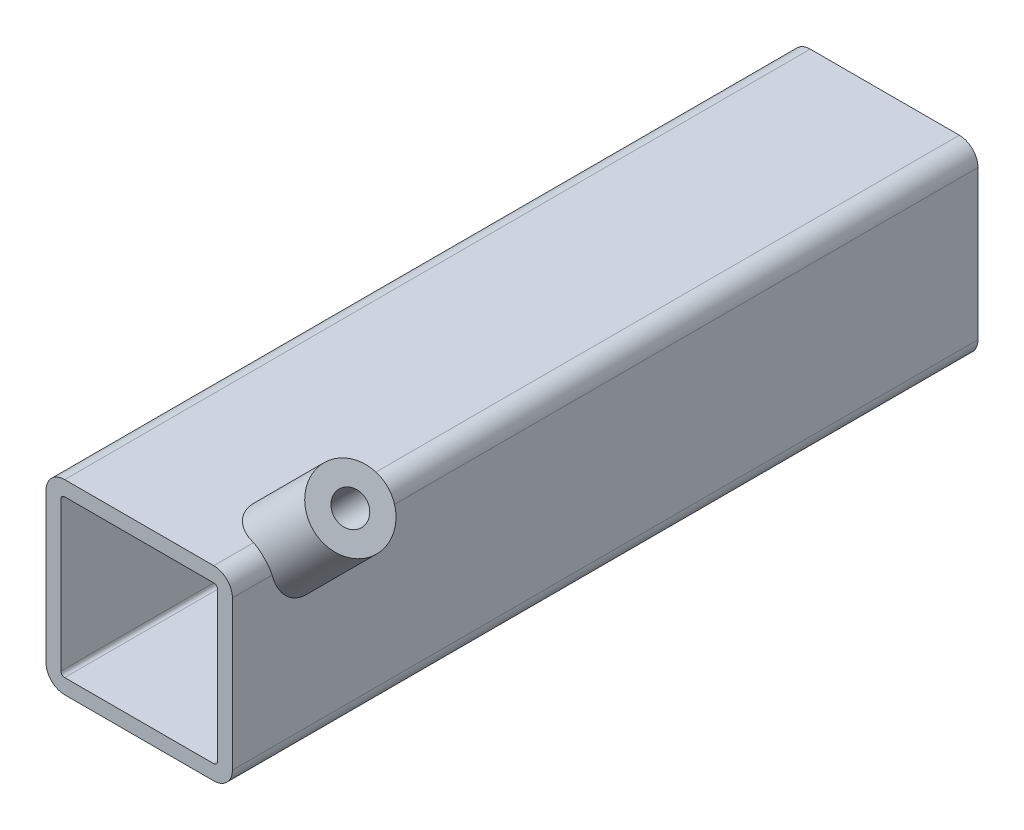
ISO-10303-21;
HEADER;
FILE_DESCRIPTION(('STEP AP214'),'2;1');
FILE_NAME('part.step','',(''),(''),'','','');
FILE_SCHEMA(('AUTOMOTIVE_DESIGN { 1 0 10303 214 1 1 1 1 }'));
ENDSEC;
DATA;
#1=APPLICATION_CONTEXT('core data for automotive mechanical design processes');
#2=APPLICATION_PROTOCOL_DEFINITION('international standard','automotive_design',2000,#1);
#3=PRODUCT_CONTEXT('',#1,'mechanical');
#4=PRODUCT('Part','Part','',(#3));
#5=PRODUCT_RELATED_PRODUCT_CATEGORY('part','',(#4));
#6=PRODUCT_DEFINITION_FORMATION('','',#4);
#7=PRODUCT_DEFINITION_CONTEXT('part definition',#1,'design');
#8=PRODUCT_DEFINITION('design','',#6,#7);
#9=PRODUCT_DEFINITION_SHAPE('','',#8);
#10=(LENGTH_UNIT() NAMED_UNIT(*) SI_UNIT(.MILLI.,.METRE.));
#11=(NAMED_UNIT(*) PLANE_ANGLE_UNIT() SI_UNIT($,.RADIAN.));
#12=(NAMED_UNIT(*) SI_UNIT($,.STERADIAN.) SOLID_ANGLE_UNIT());
#13=UNCERTAINTY_MEASURE_WITH_UNIT(LENGTH_MEASURE(1.E-05),#10,'distance_accuracy_value','');
#14=(GEOMETRIC_REPRESENTATION_CONTEXT(3) GLOBAL_UNCERTAINTY_ASSIGNED_CONTEXT((#13)) GLOBAL_UNIT_ASSIGNED_CONTEXT((#10,
#11,#12)) REPRESENTATION_CONTEXT('',''));
#15=CARTESIAN_POINT('',(0.,0.,0.));
#16=DIRECTION('',(0.,0.,1.));
#17=DIRECTION('',(1.,0.,0.));
#18=AXIS2_PLACEMENT_3D('',#15,#16,#17);
#19=CARTESIAN_POINT('',(45.,-5.,0.));
#20=DIRECTION('',(0.,0.,1.));
#21=DIRECTION('',(1.,0.,0.));
#22=AXIS2_PLACEMENT_3D('',#19,#20,#21);
#23=CYLINDRICAL_SURFACE('',#22,1.);
#24=DIRECTION('',(0.,0.,1.));
#25=VECTOR('',#24,1.);
#26=CARTESIAN_POINT('',(45.,-4.,0.));
#27=LINE('',#26,#25);
#28=CARTESIAN_POINT('',(45.,-4.,184.19076365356));
#29=VERTEX_POINT('',#28);
#30=CARTESIAN_POINT('',(45.,-4.,200.));
#31=VERTEX_POINT('',#30);
#32=EDGE_CURVE('E50',#29,#31,#27,.T.);
#33=ORIENTED_EDGE('',*,*,#32,.F.);
#34=CARTESIAN_POINT('',(45.,-4.,184.19076365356));
#35=CARTESIAN_POINT('',(45.0559582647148,-3.99995951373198,184.197454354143));
#36=CARTESIAN_POINT('',(45.1119232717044,-4.0046950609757,184.204103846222));
#37=CARTESIAN_POINT('',(45.2223794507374,-4.02344244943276,184.216656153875));
#38=CARTESIAN_POINT('',(45.2768702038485,-4.03745689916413,184.222558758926));
#39=CARTESIAN_POINT('',(45.3829114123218,-4.07450490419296,184.232953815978));
#40=CARTESIAN_POINT('',(45.4344588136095,-4.09754763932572,184.237444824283));
#41=CARTESIAN_POINT('',(45.5330191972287,-4.15202775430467,184.244506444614));
#42=CARTESIAN_POINT('',(45.5800349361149,-4.18345998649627,184.247078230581));
#43=CARTESIAN_POINT('',(45.6673764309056,-4.25322116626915,184.24998609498));
#44=CARTESIAN_POINT('',(45.7078042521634,-4.29142076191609,184.250360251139));
#45=CARTESIAN_POINT('',(45.7817667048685,-4.37397129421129,184.248933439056));
#46=CARTESIAN_POINT('',(45.8153002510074,-4.41832319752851,184.247132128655));
#47=CARTESIAN_POINT('',(45.8741924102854,-4.51134279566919,184.24158518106));
#48=CARTESIAN_POINT('',(45.8996376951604,-4.55995707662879,184.237861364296));
#49=CARTESIAN_POINT('',(45.9422124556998,-4.66056359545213,184.228878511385));
#50=CARTESIAN_POINT('',(45.9593437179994,-4.71255510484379,184.223619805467));
#51=CARTESIAN_POINT('',(45.9813894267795,-4.80394024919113,184.213702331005));
#52=CARTESIAN_POINT('',(45.988366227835,-4.84287622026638,184.209274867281));
#53=CARTESIAN_POINT('',(45.9976705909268,-4.92120482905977,184.200156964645));
#54=CARTESIAN_POINT('',(46.0000056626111,-4.96059662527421,184.195466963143));
#55=CARTESIAN_POINT('',(46.,-5.00000000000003,184.19076365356));
#56=B_SPLINE_CURVE_WITH_KNOTS('',3,(#34,#35,#36,#37,#38,#39,#40,#41,#42,#43,#44,#45,#46,#47,#48,
#49,#50,#51,#52,#53,#54,#55),.UNSPECIFIED.,.F.,.F.,(4,2,2,2,2,2,2,2,2,2,4),(0.,
0.168877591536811,0.337802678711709,0.506899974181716,0.675893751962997,0.841950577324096,
1.00803352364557,1.17227157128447,1.33647430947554,1.45562186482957,1.5745764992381),.UNSPECIFIED.);
#57=CARTESIAN_POINT('',(46.,-5.00000000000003,184.19076365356));
#58=VERTEX_POINT('',#57);
#59=EDGE_CURVE('E44',#29,#58,#56,.T.);
#60=ORIENTED_EDGE('',*,*,#59,.T.);
#61=DIRECTION('',(0.,0.,1.));
#62=VECTOR('',#61,1.);
#63=CARTESIAN_POINT('',(46.,-5.00000000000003,0.));
#64=LINE('',#63,#62);
#65=CARTESIAN_POINT('',(46.,-5.00000000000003,200.));
#66=VERTEX_POINT('',#65);
#67=EDGE_CURVE('E577',#58,#66,#64,.T.);
#68=ORIENTED_EDGE('',*,*,#67,.T.);
#69=CARTESIAN_POINT('',(45.,-5.,200.));
#70=DIRECTION('',(0.,0.,1.));
#71=DIRECTION('',(1.,0.,0.));
#72=AXIS2_PLACEMENT_3D('',#69,#70,#71);
#73=CIRCLE('',#72,1.);
#74=EDGE_CURVE('E534',#66,#31,#73,.T.);
#75=ORIENTED_EDGE('',*,*,#74,.T.);
#76=EDGE_LOOP('',(#33,#60,#68,#75));
#77=FACE_BOUND('',#76,.T.);
#78=ADVANCED_FACE('F29',(#77),#23,.F.);
#79=CARTESIAN_POINT('',(50.,-5.00000000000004,200.));
#80=DIRECTION('',(-1.,0.,0.));
#81=DIRECTION('',(0.,-1.,0.));
#82=AXIS2_PLACEMENT_3D('',#79,#80,#81);
#83=PLANE('',#82);
#84=CARTESIAN_POINT('',(50.,0.,180.));
#85=DIRECTION('',(-1.,0.,0.));
#86=DIRECTION('',(0.,-1.,0.));
#87=AXIS2_PLACEMENT_3D('',#84,#85,#86);
#88=ELLIPSE('',#87,14.1421356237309,10.);
#89=CARTESIAN_POINT('',(50.,-5.00000000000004,189.354143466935));
#90=VERTEX_POINT('',#89);
#91=CARTESIAN_POINT('',(50.,-5.00000000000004,170.645856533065));
#92=VERTEX_POINT('',#91);
#93=EDGE_CURVE('E278',#90,#92,#88,.F.);
#94=ORIENTED_EDGE('',*,*,#93,.F.);
#95=DIRECTION('',(0.,0.,-1.));
#96=VECTOR('',#95,1.);
#97=CARTESIAN_POINT('',(50.,-5.00000000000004,200.));
#98=LINE('',#97,#96);
#99=CARTESIAN_POINT('',(50.,-5.00000000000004,200.));
#100=VERTEX_POINT('',#99);
#101=EDGE_CURVE('E338',#100,#90,#98,.T.);
#102=ORIENTED_EDGE('',*,*,#101,.F.);
#103=DIRECTION('',(0.,1.,0.));
#104=VECTOR('',#103,1.);
#105=CARTESIAN_POINT('',(50.,-5.00000000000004,200.));
#106=LINE('',#105,#104);
#107=CARTESIAN_POINT('',(50.,-45.,200.));
#108=VERTEX_POINT('',#107);
#109=EDGE_CURVE('E305',#108,#100,#106,.T.);
#110=ORIENTED_EDGE('',*,*,#109,.F.);
#111=DIRECTION('',(0.,0.,-1.));
#112=VECTOR('',#111,1.);
#113=CARTESIAN_POINT('',(50.,-45.,200.));
#114=LINE('',#113,#112);
#115=CARTESIAN_POINT('',(50.,-45.,0.));
#116=VERTEX_POINT('',#115);
#117=EDGE_CURVE('E340',#108,#116,#114,.T.);
#118=ORIENTED_EDGE('',*,*,#117,.T.);
#119=DIRECTION('',(0.,1.,0.));
#120=VECTOR('',#119,1.);
#121=CARTESIAN_POINT('',(50.,-5.00000000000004,0.));
#122=LINE('',#121,#120);
#123=CARTESIAN_POINT('',(50.,-5.00000000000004,0.));
#124=VERTEX_POINT('',#123);
#125=EDGE_CURVE('E284',#116,#124,#122,.T.);
#126=ORIENTED_EDGE('',*,*,#125,.T.);
#127=EDGE_CURVE('E337',#92,#124,#98,.T.);
#128=ORIENTED_EDGE('',*,*,#127,.F.);
#129=EDGE_LOOP('',(#94,#102,#110,#118,#126,#128));
#130=FACE_BOUND('',#129,.T.);
#131=ADVANCED_FACE('F249',(#130),#83,.F.);
#132=CARTESIAN_POINT('',(45.,-5.,200.));
#133=DIRECTION('',(0.,0.,-1.));
#134=DIRECTION('',(-1.,0.,0.));
#135=AXIS2_PLACEMENT_3D('',#132,#133,#134);
#136=CYLINDRICAL_SURFACE('',#135,5.);
#137=CARTESIAN_POINT('',(40.,-5.,189.354143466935));
#138=CARTESIAN_POINT('',(40.0000008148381,-4.72265838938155,189.280016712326));
#139=CARTESIAN_POINT('',(40.0230750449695,-4.44531545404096,189.204985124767));
#140=CARTESIAN_POINT('',(40.1154234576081,-3.89613450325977,189.060945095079));
#141=CARTESIAN_POINT('',(40.184782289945,-3.62430751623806,188.991947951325));
#142=CARTESIAN_POINT('',(40.3233319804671,-3.225525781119,188.899220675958));
#143=CARTESIAN_POINT('',(40.3754602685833,-3.09373839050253,188.870040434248));
#144=CARTESIAN_POINT('',(40.4911309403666,-2.83430337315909,188.816370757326));
#145=CARTESIAN_POINT('',(40.5546680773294,-2.70665387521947,188.791879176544));
#146=CARTESIAN_POINT('',(40.6928077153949,-2.45668198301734,188.748559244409));
#147=CARTESIAN_POINT('',(40.7673968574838,-2.33435338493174,188.729724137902));
#148=CARTESIAN_POINT('',(40.9272389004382,-2.09600346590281,188.698473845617));
#149=CARTESIAN_POINT('',(41.0124904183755,-1.97998132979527,188.686057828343));
#150=CARTESIAN_POINT('',(41.1848327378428,-1.76554810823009,188.669007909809));
#151=CARTESIAN_POINT('',(41.2710636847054,-1.66649253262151,188.663772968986));
#152=CARTESIAN_POINT('',(41.4511287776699,-1.4754087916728,188.659277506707));
#153=CARTESIAN_POINT('',(41.5449624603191,-1.38338019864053,188.660016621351));
#154=CARTESIAN_POINT('',(41.7394532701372,-1.20710376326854,188.66744051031));
#155=CARTESIAN_POINT('',(41.8401105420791,-1.12285608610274,188.67412541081));
#156=CARTESIAN_POINT('',(42.0473877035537,-0.962769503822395,188.693182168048));
#157=CARTESIAN_POINT('',(42.1540075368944,-0.886930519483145,188.705553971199));
#158=CARTESIAN_POINT('',(42.3651026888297,-0.748864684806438,188.734534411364));
#159=CARTESIAN_POINT('',(42.4692529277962,-0.686069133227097,188.750808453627));
#160=CARTESIAN_POINT('',(42.681305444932,-0.568479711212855,188.787419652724));
#161=CARTESIAN_POINT('',(42.7892089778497,-0.513688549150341,188.807758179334));
#162=CARTESIAN_POINT('',(43.1175156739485,-0.361643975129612,188.874019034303));
#163=CARTESIAN_POINT('',(43.3426487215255,-0.276632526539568,188.925206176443));
#164=CARTESIAN_POINT('',(43.8219139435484,-0.133747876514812,189.041682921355));
#165=CARTESIAN_POINT('',(44.0767943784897,-0.0791387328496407,189.107841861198));
#166=CARTESIAN_POINT('',(44.5909471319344,-0.0100042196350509,189.244165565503));
#167=CARTESIAN_POINT('',(44.8502221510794,0.00449553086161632,189.314332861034));
#168=CARTESIAN_POINT('',(45.3970861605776,-0.0075156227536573,189.459915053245));
#169=CARTESIAN_POINT('',(45.6846773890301,-0.0386744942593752,189.535067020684));
#170=CARTESIAN_POINT('',(46.1104389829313,-0.122712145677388,189.639564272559));
#171=CARTESIAN_POINT('',(46.2514992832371,-0.156970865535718,189.673041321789));
#172=CARTESIAN_POINT('',(46.5308289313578,-0.237892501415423,189.736354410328));
#173=CARTESIAN_POINT('',(46.6690996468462,-0.2845491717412,189.766192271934));
#174=CARTESIAN_POINT('',(46.9387964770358,-0.388977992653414,189.820766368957));
#175=CARTESIAN_POINT('',(47.0703062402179,-0.44648318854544,189.845600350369));
#176=CARTESIAN_POINT('',(47.3285138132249,-0.572961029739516,189.890251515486));
#177=CARTESIAN_POINT('',(47.4552139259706,-0.641928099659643,189.910071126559));
#178=CARTESIAN_POINT('',(47.7026611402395,-0.79090639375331,189.944106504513));
#179=CARTESIAN_POINT('',(47.8234111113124,-0.870912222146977,189.958324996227));
#180=CARTESIAN_POINT('',(48.0578626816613,-1.0414046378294,189.980729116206));
#181=CARTESIAN_POINT('',(48.1715650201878,-1.13189012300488,189.988915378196));
#182=CARTESIAN_POINT('',(48.3797733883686,-1.31296742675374,189.998490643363));
#183=CARTESIAN_POINT('',(48.4750598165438,-1.40263259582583,190.00048066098));
#184=CARTESIAN_POINT('',(48.6583273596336,-1.58917310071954,189.999323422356));
#185=CARTESIAN_POINT('',(48.7463060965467,-1.68605076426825,189.996174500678));
#186=CARTESIAN_POINT('',(48.914224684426,-1.88617604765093,189.984820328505));
#187=CARTESIAN_POINT('',(48.9941684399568,-1.98942053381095,189.976617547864));
#188=CARTESIAN_POINT('',(49.1455561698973,-2.20154484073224,189.955365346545));
#189=CARTESIAN_POINT('',(49.2169969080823,-2.3104267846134,189.942314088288));
#190=CARTESIAN_POINT('',(49.3487716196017,-2.52937678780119,189.912183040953));
#191=CARTESIAN_POINT('',(49.4093887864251,-2.6392942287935,189.895246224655));
#192=CARTESIAN_POINT('',(49.5219771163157,-2.86285037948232,189.857525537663));
#193=CARTESIAN_POINT('',(49.57394527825,-2.97649036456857,189.836740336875));
#194=CARTESIAN_POINT('',(49.7165361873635,-3.32184055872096,189.769282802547));
#195=CARTESIAN_POINT('',(49.7939446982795,-3.55814713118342,189.717484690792));
#196=CARTESIAN_POINT('',(49.9169476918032,-4.05461639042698,189.600442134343));
#197=CARTESIAN_POINT('',(49.959846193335,-4.31527073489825,189.534497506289));
#198=CARTESIAN_POINT('',(50.0043173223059,-4.83888911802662,189.397699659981));
#199=CARTESIAN_POINT('',(50.005860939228,-5.10185464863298,189.326843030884));
#200=CARTESIAN_POINT('',(49.9658816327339,-5.64975877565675,189.180050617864));
#201=CARTESIAN_POINT('',(49.920344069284,-5.93446889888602,189.104254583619));
#202=CARTESIAN_POINT('',(49.8153130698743,-6.35411576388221,188.998658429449));
#203=CARTESIAN_POINT('',(49.774147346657,-6.4928401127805,188.96479204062));
#204=CARTESIAN_POINT('',(49.6796217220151,-6.76695289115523,188.900892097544));
#205=CARTESIAN_POINT('',(49.6262682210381,-6.90234303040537,188.870856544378));
#206=CARTESIAN_POINT('',(49.508600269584,-7.16634036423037,188.816232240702));
#207=CARTESIAN_POINT('',(49.44450432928,-7.29502635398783,188.79155385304));
#208=CARTESIAN_POINT('',(49.3050140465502,-7.54707321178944,188.747943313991));
#209=CARTESIAN_POINT('',(49.2296257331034,-7.67043687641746,188.729008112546));
#210=CARTESIAN_POINT('',(49.0680728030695,-7.91062028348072,188.697697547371));
#211=CARTESIAN_POINT('',(48.9819182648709,-8.02744599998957,188.685316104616));
#212=CARTESIAN_POINT('',(48.7994774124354,-8.25346805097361,188.667658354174));
#213=CARTESIAN_POINT('',(48.7031925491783,-8.36266547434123,188.662381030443));
#214=CARTESIAN_POINT('',(48.5141854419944,-8.55902445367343,188.659379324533));
#215=CARTESIAN_POINT('',(48.4225533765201,-8.64722612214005,188.660783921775));
#216=CARTESIAN_POINT('',(48.2329479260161,-8.81630537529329,188.669145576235));
#217=CARTESIAN_POINT('',(48.1349725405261,-8.89718063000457,188.676104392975));
#218=CARTESIAN_POINT('',(47.9335068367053,-9.05099891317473,188.695327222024));
#219=CARTESIAN_POINT('',(47.8300176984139,-9.12394362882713,188.707590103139));
#220=CARTESIAN_POINT('',(47.618292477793,-9.26151498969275,188.736991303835));
#221=CARTESIAN_POINT('',(47.5100545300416,-9.32613832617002,188.754131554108));
#222=CARTESIAN_POINT('',(47.184634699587,-9.50415569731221,188.811145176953));
#223=CARTESIAN_POINT('',(46.961765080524,-9.60546426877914,188.857133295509));
#224=CARTESIAN_POINT('',(46.5062037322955,-9.77393829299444,188.960625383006));
#225=CARTESIAN_POINT('',(46.2735085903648,-9.84109177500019,189.018133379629));
#226=CARTESIAN_POINT('',(45.7747538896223,-9.94693240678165,189.14643225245));
#227=CARTESIAN_POINT('',(45.5079842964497,-9.98135253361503,189.2179899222));
#228=CARTESIAN_POINT('',(44.9722544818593,-10.0071093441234,189.361653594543));
#229=CARTESIAN_POINT('',(44.7032929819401,-9.99841877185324,189.433759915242));
#230=CARTESIAN_POINT('',(44.2915496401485,-9.95169753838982,189.540012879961));
#231=CARTESIAN_POINT('',(44.1474678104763,-9.92894988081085,189.576402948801));
#232=CARTESIAN_POINT('',(43.8612083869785,-9.87077611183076,189.646355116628));
#233=CARTESIAN_POINT('',(43.7190300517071,-9.83535509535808,189.679918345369));
#234=CARTESIAN_POINT('',(43.4375561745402,-9.75187589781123,189.743275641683));
#235=CARTESIAN_POINT('',(43.2982608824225,-9.70381662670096,189.773069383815));
#236=CARTESIAN_POINT('',(43.023739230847,-9.59523261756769,189.827999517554));
#237=CARTESIAN_POINT('',(42.8885106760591,-9.53471474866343,189.853138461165));
#238=CARTESIAN_POINT('',(42.630818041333,-9.40528839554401,189.896728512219));
#239=CARTESIAN_POINT('',(42.5080657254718,-9.33705469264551,189.915479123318));
#240=CARTESIAN_POINT('',(42.2682936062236,-9.19017100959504,189.947631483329));
#241=CARTESIAN_POINT('',(42.1512710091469,-9.1115261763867,189.961035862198));
#242=CARTESIAN_POINT('',(41.9240087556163,-8.944384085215,189.982108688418));
#243=CARTESIAN_POINT('',(41.8137662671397,-8.85589098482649,189.989779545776));
#244=CARTESIAN_POINT('',(41.601038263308,-8.66974524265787,189.999162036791));
#245=CARTESIAN_POINT('',(41.498552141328,-8.57209331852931,190.000874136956));
#246=CARTESIAN_POINT('',(41.3115267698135,-8.37810174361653,189.998411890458));
#247=CARTESIAN_POINT('',(41.2262064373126,-8.28250609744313,189.994777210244));
#248=CARTESIAN_POINT('',(41.0632623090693,-8.08520210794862,189.982670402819));
#249=CARTESIAN_POINT('',(40.9856410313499,-7.98349178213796,189.974196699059));
#250=CARTESIAN_POINT('',(40.8386310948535,-7.7747608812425,189.952617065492));
#251=CARTESIAN_POINT('',(40.7692418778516,-7.66774066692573,189.939511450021));
#252=CARTESIAN_POINT('',(40.6390599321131,-7.44916486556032,189.908987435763));
#253=CARTESIAN_POINT('',(40.5782703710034,-7.33760762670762,189.891567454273));
#254=CARTESIAN_POINT('',(40.4093571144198,-6.99748285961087,189.833443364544));
#255=CARTESIAN_POINT('',(40.3144915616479,-6.76318051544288,189.786844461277));
#256=CARTESIAN_POINT('',(40.1616411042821,-6.28574567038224,189.682042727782));
#257=CARTESIAN_POINT('',(40.1036206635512,-6.04262191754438,189.62385114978));
#258=CARTESIAN_POINT('',(40.0426595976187,-5.66537431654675,189.529031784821));
#259=CARTESIAN_POINT('',(40.0266584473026,-5.53261985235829,189.494815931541));
#260=CARTESIAN_POINT('',(40.0053284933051,-5.26657702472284,189.425184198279));
#261=CARTESIAN_POINT('',(39.9999996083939,-5.13328866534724,189.389768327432));
#262=CARTESIAN_POINT('',(40.,-5.,189.354143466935));
#263=B_SPLINE_CURVE_WITH_KNOTS('',3,(#137,#138,#139,#140,#141,#142,#143,#144,#145,#146,#147,
#148,#149,#150,#151,#152,#153,#154,#155,#156,#157,#158,#159,#160,#161,#162,#163,#164,#165,#166,
#167,#168,#169,#170,#171,#172,#173,#174,#175,#176,#177,#178,#179,#180,#181,#182,#183,#184,#185,
#186,#187,#188,#189,#190,#191,#192,#193,#194,#195,#196,#197,#198,#199,#200,#201,#202,#203,#204,
#205,#206,#207,#208,#209,#210,#211,#212,#213,#214,#215,#216,#217,#218,#219,#220,#221,#222,#223,
#224,#225,#226,#227,#228,#229,#230,#231,#232,#233,#234,#235,#236,#237,#238,#239,#240,#241,#242,
#243,#244,#245,#246,#247,#248,#249,#250,#251,#252,#253,#254,#255,#256,#257,#258,#259,#260,#261,
#262),.UNSPECIFIED.,.T.,.F.,(4,2,2,2,2,2,2,2,2,2,2,2,2,2,2,2,2,2,2,2,2,2,2,2,2,2,2,2,2,2,2,2,2,
2,2,2,2,2,2,2,2,2,2,2,2,2,2,2,2,2,2,2,2,2,2,2,2,2,2,2,2,2,4),(0.,0.860790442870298,
1.7231595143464,2.15675818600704,2.59015796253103,3.02303808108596,3.45586211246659,
3.84963683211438,4.24338756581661,4.63714665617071,5.03090203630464,5.39859766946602,
5.76641742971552,6.50157996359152,7.30519709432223,8.10932740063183,9.00120866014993,
9.44764890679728,9.8938646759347,10.330269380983,10.7664624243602,11.202443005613,
11.6383777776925,12.0304525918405,12.4226544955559,12.8146648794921,13.2068239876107,
13.5863779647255,13.9660633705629,14.7248557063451,15.5383532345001,16.3524214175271,
17.2421247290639,17.6874942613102,18.1326304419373,18.5696186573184,19.0063743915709,
19.4427242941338,19.8790117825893,20.2601073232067,20.6413236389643,21.0224586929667,
21.4037448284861,22.1477419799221,22.8919997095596,23.7236251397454,24.5557764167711,
25.0063055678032,25.4566538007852,25.9070408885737,26.3571803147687,26.7816649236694,
27.2059404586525,27.6300375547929,28.0541014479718,28.4381914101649,28.8224065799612,
29.2065956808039,29.5909259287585,30.358562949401,31.1254584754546,31.5391521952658,
31.95284276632),.UNSPECIFIED.);
#264=CARTESIAN_POINT('',(45.,0.,189.354143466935));
#265=VERTEX_POINT('',#264);
#266=EDGE_CURVE('E199',#265,#90,#263,.T.);
#267=ORIENTED_EDGE('',*,*,#266,.F.);
#268=DIRECTION('',(0.,0.,-1.));
#269=VECTOR('',#268,1.);
#270=CARTESIAN_POINT('',(45.,0.,200.));
#271=LINE('',#270,#269);
#272=CARTESIAN_POINT('',(45.,0.,200.));
#273=VERTEX_POINT('',#272);
#274=EDGE_CURVE('E335',#273,#265,#271,.T.);
#275=ORIENTED_EDGE('',*,*,#274,.F.);
#276=CARTESIAN_POINT('',(45.,-5.,200.));
#277=DIRECTION('',(0.,0.,1.));
#278=DIRECTION('',(1.,0.,0.));
#279=AXIS2_PLACEMENT_3D('',#276,#277,#278);
#280=CIRCLE('',#279,5.);
#281=EDGE_CURVE('E307',#100,#273,#280,.T.);
#282=ORIENTED_EDGE('',*,*,#281,.F.);
#283=ORIENTED_EDGE('',*,*,#101,.T.);
#284=EDGE_LOOP('',(#267,#275,#282,#283));
#285=FACE_BOUND('',#284,.T.);
#286=ADVANCED_FACE('F203',(#285),#136,.T.);
#287=CARTESIAN_POINT('',(40.,-5.,170.645856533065));
#288=CARTESIAN_POINT('',(40.0000019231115,-5.27425698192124,170.572561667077));
#289=CARTESIAN_POINT('',(40.0225673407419,-5.54895561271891,170.500028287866));
#290=CARTESIAN_POINT('',(40.1132394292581,-6.09350953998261,170.363577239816));
#291=CARTESIAN_POINT('',(40.1814101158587,-6.36335748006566,170.299671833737));
#292=CARTESIAN_POINT('',(40.3176179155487,-6.75924685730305,170.215094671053));
#293=CARTESIAN_POINT('',(40.3688448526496,-6.89003568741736,170.188732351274));
#294=CARTESIAN_POINT('',(40.4824794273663,-7.14750472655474,170.140524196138));
#295=CARTESIAN_POINT('',(40.5448822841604,-7.27418666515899,170.118676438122));
#296=CARTESIAN_POINT('',(40.6805219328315,-7.52231923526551,170.08012661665));
#297=CARTESIAN_POINT('',(40.7537515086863,-7.64377328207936,170.063421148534));
#298=CARTESIAN_POINT('',(40.9106065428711,-7.88045275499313,170.035624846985));
#299=CARTESIAN_POINT('',(40.9942310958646,-7.99567872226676,170.024533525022));
#300=CARTESIAN_POINT('',(41.1647506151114,-8.21065193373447,170.008894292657));
#301=CARTESIAN_POINT('',(41.2509581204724,-8.31091481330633,170.003926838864));
#302=CARTESIAN_POINT('',(41.4311481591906,-8.50439380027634,169.999230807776));
#303=CARTESIAN_POINT('',(41.5251333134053,-8.59760751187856,169.999504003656));
#304=CARTESIAN_POINT('',(41.720063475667,-8.7761726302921,170.005285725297));
#305=CARTESIAN_POINT('',(41.8210052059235,-8.86152769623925,170.010791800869));
#306=CARTESIAN_POINT('',(42.0291088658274,-9.02383235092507,170.026892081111));
#307=CARTESIAN_POINT('',(42.1362731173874,-9.10077877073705,170.037488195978));
#308=CARTESIAN_POINT('',(42.3509411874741,-9.24243583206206,170.062904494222));
#309=CARTESIAN_POINT('',(42.458208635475,-9.30754341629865,170.077511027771));
#310=CARTESIAN_POINT('',(42.6768553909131,-9.4292980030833,170.110770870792));
#311=CARTESIAN_POINT('',(42.7882361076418,-9.48594207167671,170.129425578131));
#312=CARTESIAN_POINT('',(43.1273737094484,-9.64275665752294,170.190854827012));
#313=CARTESIAN_POINT('',(43.3602997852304,-9.72992352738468,170.239116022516));
#314=CARTESIAN_POINT('',(43.8484806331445,-9.87264555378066,170.349470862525));
#315=CARTESIAN_POINT('',(44.1042313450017,-9.9259522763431,170.412227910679));
#316=CARTESIAN_POINT('',(44.619380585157,-9.99225489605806,170.5441516));
#317=CARTESIAN_POINT('',(44.8787812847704,-10.005225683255,170.613322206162));
#318=CARTESIAN_POINT('',(45.4216669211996,-9.99029233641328,170.758825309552));
#319=CARTESIAN_POINT('',(45.7050316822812,-9.95827556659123,170.835197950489));
#320=CARTESIAN_POINT('',(46.2644970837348,-9.84585399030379,170.979904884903));
#321=CARTESIAN_POINT('',(46.540596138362,-9.76543871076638,171.048237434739));
#322=CARTESIAN_POINT('',(46.9438740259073,-9.60893784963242,171.138023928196));
#323=CARTESIAN_POINT('',(47.0767361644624,-9.55064257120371,171.165875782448));
#324=CARTESIAN_POINT('',(47.3376666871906,-9.42226373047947,171.216236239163));
#325=CARTESIAN_POINT('',(47.4657375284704,-9.35218631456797,171.238747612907));
#326=CARTESIAN_POINT('',(47.715810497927,-9.20068221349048,171.277462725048));
#327=CARTESIAN_POINT('',(47.837818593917,-9.11926700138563,171.293672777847));
#328=CARTESIAN_POINT('',(48.0746628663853,-8.94562995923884,171.319077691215));
#329=CARTESIAN_POINT('',(48.1895001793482,-8.85340984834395,171.328273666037));
#330=CARTESIAN_POINT('',(48.3971725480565,-8.67095509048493,171.338541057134));
#331=CARTESIAN_POINT('',(48.49097731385,-8.58186875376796,171.340471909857));
#332=CARTESIAN_POINT('',(48.6714011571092,-8.3966937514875,171.338532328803));
#333=CARTESIAN_POINT('',(48.7580179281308,-8.30060285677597,171.334660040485));
#334=CARTESIAN_POINT('',(48.9233422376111,-8.10226415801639,171.321255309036));
#335=CARTESIAN_POINT('',(49.0020523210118,-8.00001835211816,171.311724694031));
#336=CARTESIAN_POINT('',(49.1510900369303,-7.79016901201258,171.287362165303));
#337=CARTESIAN_POINT('',(49.221414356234,-7.68256338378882,171.272528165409));
#338=CARTESIAN_POINT('',(49.4128994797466,-7.36341910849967,171.222447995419));
#339=CARTESIAN_POINT('',(49.5225703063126,-7.14583355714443,171.180869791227));
#340=CARTESIAN_POINT('',(49.7084669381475,-6.69967700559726,171.084927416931));
#341=CARTESIAN_POINT('',(49.7846819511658,-6.47110248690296,171.030559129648));
#342=CARTESIAN_POINT('',(49.9096833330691,-5.98245286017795,170.908039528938));
#343=CARTESIAN_POINT('',(49.9546712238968,-5.72162057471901,170.839036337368));
#344=CARTESIAN_POINT('',(50.003089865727,-5.19652651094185,170.69864228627));
#345=CARTESIAN_POINT('',(50.0064934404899,-4.9322626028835,170.6272498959));
#346=CARTESIAN_POINT('',(49.979445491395,-4.52446918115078,170.519981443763));
#347=CARTESIAN_POINT('',(49.963567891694,-4.38023069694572,170.48260651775));
#348=CARTESIAN_POINT('',(49.9192155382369,-4.09314174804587,170.410134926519));
#349=CARTESIAN_POINT('',(49.8907455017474,-3.95029078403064,170.375037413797));
#350=CARTESIAN_POINT('',(49.8212109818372,-3.66687450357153,170.308079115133));
#351=CARTESIAN_POINT('',(49.7801435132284,-3.52630973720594,170.276219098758));
#352=CARTESIAN_POINT('',(49.685523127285,-3.24860808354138,170.216665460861));
#353=CARTESIAN_POINT('',(49.6319768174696,-3.11146942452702,170.188969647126));
#354=CARTESIAN_POINT('',(49.5149844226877,-2.84710323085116,170.139558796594));
#355=CARTESIAN_POINT('',(49.4520210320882,-2.71969875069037,170.117648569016));
#356=CARTESIAN_POINT('',(49.315115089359,-2.47017399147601,170.07904260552));
#357=CARTESIAN_POINT('',(49.2411779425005,-2.34805114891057,170.062344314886));
#358=CARTESIAN_POINT('',(49.0828181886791,-2.11019024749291,170.034651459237));
#359=CARTESIAN_POINT('',(48.9984001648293,-1.99444942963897,170.023654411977));
#360=CARTESIAN_POINT('',(48.8197125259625,-1.77039909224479,170.0076922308));
#361=CARTESIAN_POINT('',(48.7254438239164,-1.66208888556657,170.002726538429));
#362=CARTESIAN_POINT('',(48.5376599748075,-1.46422772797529,169.999164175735));
#363=CARTESIAN_POINT('',(48.4449920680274,-1.37388084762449,169.999986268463));
#364=CARTESIAN_POINT('',(48.2529977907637,-1.20069446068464,170.006629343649));
#365=CARTESIAN_POINT('',(48.1536692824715,-1.11785738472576,170.012451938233));
#366=CARTESIAN_POINT('',(47.9491980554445,-0.960336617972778,170.028947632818));
#367=CARTESIAN_POINT('',(47.8440578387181,-0.885649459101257,170.039618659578));
#368=CARTESIAN_POINT('',(47.6286901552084,-0.744820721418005,170.065549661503));
#369=CARTESIAN_POINT('',(47.5184607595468,-0.678682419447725,170.080811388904));
#370=CARTESIAN_POINT('',(47.2956762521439,-0.55638234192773,170.115259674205));
#371=CARTESIAN_POINT('',(47.18319294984,-0.500069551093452,170.134374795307));
#372=CARTESIAN_POINT('',(46.9548635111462,-0.396277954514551,170.176251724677));
#373=CARTESIAN_POINT('',(46.8390162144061,-0.348802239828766,170.199014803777));
#374=CARTESIAN_POINT('',(46.487559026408,-0.219900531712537,170.272046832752));
#375=CARTESIAN_POINT('',(46.2478744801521,-0.151913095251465,170.327084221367));
#376=CARTESIAN_POINT('',(45.7434428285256,-0.0483382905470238,170.450155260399));
#377=CARTESIAN_POINT('',(45.4782426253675,-0.0158351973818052,170.518881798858));
#378=CARTESIAN_POINT('',(44.9468090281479,0.00679767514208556,170.659676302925));
#379=CARTESIAN_POINT('',(44.6805750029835,-0.00310470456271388,170.731746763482));
#380=CARTESIAN_POINT('',(44.1291944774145,-0.0679553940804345,170.878520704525));
#381=CARTESIAN_POINT('',(43.8443841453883,-0.126694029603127,170.952919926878));
#382=CARTESIAN_POINT('',(43.4261491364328,-0.251921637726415,171.054467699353));
#383=CARTESIAN_POINT('',(43.2881729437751,-0.299881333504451,171.086654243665));
#384=CARTESIAN_POINT('',(43.0161440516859,-0.408082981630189,171.146534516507));
#385=CARTESIAN_POINT('',(42.8820891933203,-0.468318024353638,171.17423075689));
#386=CARTESIAN_POINT('',(42.6241638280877,-0.598246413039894,171.22305955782));
#387=CARTESIAN_POINT('',(42.5001001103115,-0.667475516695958,171.244407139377));
#388=CARTESIAN_POINT('',(42.2577399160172,-0.816671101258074,171.281081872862));
#389=CARTESIAN_POINT('',(42.1394403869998,-0.896631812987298,171.296412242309));
#390=CARTESIAN_POINT('',(41.9097869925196,-1.06668322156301,171.320391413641));
#391=CARTESIAN_POINT('',(41.7984273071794,-1.15676524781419,171.329045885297));
#392=CARTESIAN_POINT('',(41.5836812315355,-1.34633455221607,171.33929729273));
#393=CARTESIAN_POINT('',(41.4802938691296,-1.44582068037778,171.340895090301));
#394=CARTESIAN_POINT('',(41.2949429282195,-1.64019942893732,171.337211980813));
#395=CARTESIAN_POINT('',(41.211919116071,-1.73410126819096,171.332769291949));
#396=CARTESIAN_POINT('',(41.0533062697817,-1.92766067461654,171.318595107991));
#397=CARTESIAN_POINT('',(40.9777196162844,-2.02732006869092,171.308861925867));
#398=CARTESIAN_POINT('',(40.8344677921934,-2.23162384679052,171.284435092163));
#399=CARTESIAN_POINT('',(40.7668039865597,-2.33626908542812,171.269740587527));
#400=CARTESIAN_POINT('',(40.6397366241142,-2.54978373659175,171.235874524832));
#401=CARTESIAN_POINT('',(40.5803362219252,-2.65865474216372,171.216701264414));
#402=CARTESIAN_POINT('',(40.4148853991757,-2.99057927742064,171.153302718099));
#403=CARTESIAN_POINT('',(40.3215548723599,-3.21898808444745,171.103193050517));
#404=CARTESIAN_POINT('',(40.1699842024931,-3.68437329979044,170.992736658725));
#405=CARTESIAN_POINT('',(40.11171192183,-3.92134164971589,170.932399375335));
#406=CARTESIAN_POINT('',(40.0473279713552,-4.29937189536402,170.833317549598));
#407=CARTESIAN_POINT('',(40.0295896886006,-4.43896457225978,170.796133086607));
#408=CARTESIAN_POINT('',(40.005924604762,-4.7189994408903,170.721184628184));
#409=CARTESIAN_POINT('',(39.9999990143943,-4.85944171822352,170.683420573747));
#410=CARTESIAN_POINT('',(40.,-5.,170.645856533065));
#411=B_SPLINE_CURVE_WITH_KNOTS('',3,(#287,#288,#289,#290,#291,#292,#293,#294,#295,#296,#297,
#298,#299,#300,#301,#302,#303,#304,#305,#306,#307,#308,#309,#310,#311,#312,#313,#314,#315,#316,
#317,#318,#319,#320,#321,#322,#323,#324,#325,#326,#327,#328,#329,#330,#331,#332,#333,#334,#335,
#336,#337,#338,#339,#340,#341,#342,#343,#344,#345,#346,#347,#348,#349,#350,#351,#352,#353,#354,
#355,#356,#357,#358,#359,#360,#361,#362,#363,#364,#365,#366,#367,#368,#369,#370,#371,#372,#373,
#374,#375,#376,#377,#378,#379,#380,#381,#382,#383,#384,#385,#386,#387,#388,#389,#390,#391,#392,
#393,#394,#395,#396,#397,#398,#399,#400,#401,#402,#403,#404,#405,#406,#407,#408,#409,#410),
.UNSPECIFIED.,.T.,.F.,(4,2,2,2,2,2,2,2,2,2,2,2,2,2,2,2,2,2,2,2,2,2,2,2,2,2,2,2,2,2,2,2,2,2,2,2,
2,2,2,2,2,2,2,2,2,2,2,2,2,2,2,2,2,2,2,2,2,2,2,2,2,4),(0.,0.851183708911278,1.70356473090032,
2.13183636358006,2.5599252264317,2.98773004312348,3.41549762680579,3.81195300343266,
4.20854252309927,4.60494643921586,5.00149923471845,5.38004571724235,5.75872312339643,
6.5154584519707,7.31827887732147,8.12159897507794,9.00331731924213,9.88522652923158,
10.3279079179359,10.7703590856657,11.2123657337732,11.6543021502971,12.0419375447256,
12.4296968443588,12.8173309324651,13.2051176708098,13.9433416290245,14.6818035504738,
15.4991293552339,16.3169892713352,16.7660590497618,17.2149607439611,17.663968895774,
18.1127398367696,18.5435273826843,18.974103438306,19.4044918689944,19.8348404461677,
20.2226346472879,20.610553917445,20.9983074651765,21.3862092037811,21.7674900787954,
22.1489040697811,22.9111882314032,23.7354596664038,24.5603563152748,25.4559964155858,
25.9042281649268,26.3522083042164,26.7825986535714,27.2127585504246,27.6425527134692,
28.0722943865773,28.4480964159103,28.8240183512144,29.2000049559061,29.5761347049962,
30.3282351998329,31.0796451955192,31.5158370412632,31.9520735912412),.UNSPECIFIED.);
#412=CARTESIAN_POINT('',(45.,0.,170.645856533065));
#413=VERTEX_POINT('',#412);
#414=EDGE_CURVE('E192',#92,#413,#411,.T.);
#415=ORIENTED_EDGE('',*,*,#414,.F.);
#416=ORIENTED_EDGE('',*,*,#127,.T.);
#417=CARTESIAN_POINT('',(45.,-5.,0.));
#418=DIRECTION('',(0.,0.,1.));
#419=DIRECTION('',(1.,0.,0.));
#420=AXIS2_PLACEMENT_3D('',#417,#418,#419);
#421=CIRCLE('',#420,5.);
#422=CARTESIAN_POINT('',(45.,0.,0.));
#423=VERTEX_POINT('',#422);
#424=EDGE_CURVE('E289',#124,#423,#421,.T.);
#425=ORIENTED_EDGE('',*,*,#424,.T.);
#426=EDGE_CURVE('E334',#413,#423,#271,.T.);
#427=ORIENTED_EDGE('',*,*,#426,.F.);
#428=EDGE_LOOP('',(#415,#416,#425,#427));
#429=FACE_BOUND('',#428,.T.);
#430=ADVANCED_FACE('F240',(#429),#136,.T.);
#431=CARTESIAN_POINT('',(5.00000000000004,0.,200.));
#432=DIRECTION('',(0.,-1.,0.));
#433=DIRECTION('',(0.,0.,-1.));
#434=AXIS2_PLACEMENT_3D('',#431,#432,#433);
#435=PLANE('',#434);
#436=CARTESIAN_POINT('',(50.,0.,180.));
#437=DIRECTION('',(0.,-1.,0.));
#438=DIRECTION('',(-1.,0.,0.));
#439=AXIS2_PLACEMENT_3D('',#436,#437,#438);
#440=ELLIPSE('',#439,14.142135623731,10.);
#441=EDGE_CURVE('E37',#413,#265,#440,.F.);
#442=ORIENTED_EDGE('',*,*,#441,.F.);
#443=ORIENTED_EDGE('',*,*,#426,.T.);
#444=DIRECTION('',(-1.,0.,0.));
#445=VECTOR('',#444,1.);
#446=CARTESIAN_POINT('',(5.00000000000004,0.,0.));
#447=LINE('',#446,#445);
#448=CARTESIAN_POINT('',(5.00000000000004,0.,0.));
#449=VERTEX_POINT('',#448);
#450=EDGE_CURVE('E292',#423,#449,#447,.T.);
#451=ORIENTED_EDGE('',*,*,#450,.T.);
#452=DIRECTION('',(0.,0.,-1.));
#453=VECTOR('',#452,1.);
#454=CARTESIAN_POINT('',(5.00000000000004,0.,200.));
#455=LINE('',#454,#453);
#456=CARTESIAN_POINT('',(5.00000000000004,0.,200.));
#457=VERTEX_POINT('',#456);
#458=EDGE_CURVE('E331',#457,#449,#455,.T.);
#459=ORIENTED_EDGE('',*,*,#458,.F.);
#460=DIRECTION('',(-1.,0.,0.));
#461=VECTOR('',#460,1.);
#462=CARTESIAN_POINT('',(5.00000000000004,0.,200.));
#463=LINE('',#462,#461);
#464=EDGE_CURVE('E309',#273,#457,#463,.T.);
#465=ORIENTED_EDGE('',*,*,#464,.F.);
#466=ORIENTED_EDGE('',*,*,#274,.T.);
#467=EDGE_LOOP('',(#442,#443,#451,#459,#465,#466));
#468=FACE_BOUND('',#467,.T.);
#469=ADVANCED_FACE('F238',(#468),#435,.F.);
#470=CARTESIAN_POINT('',(45.,-45.,200.));
#471=DIRECTION('',(0.,0.,-1.));
#472=DIRECTION('',(-1.,0.,0.));
#473=AXIS2_PLACEMENT_3D('',#470,#471,#472);
#474=CYLINDRICAL_SURFACE('',#473,5.);
#475=CARTESIAN_POINT('',(45.,-45.,0.));
#476=DIRECTION('',(0.,0.,1.));
#477=DIRECTION('',(-1.,0.,0.));
#478=AXIS2_PLACEMENT_3D('',#475,#476,#477);
#479=CIRCLE('',#478,5.);
#480=CARTESIAN_POINT('',(45.,-50.,0.));
#481=VERTEX_POINT('',#480);
#482=EDGE_CURVE('E282',#481,#116,#479,.T.);
#483=ORIENTED_EDGE('',*,*,#482,.T.);
#484=ORIENTED_EDGE('',*,*,#117,.F.);
#485=CARTESIAN_POINT('',(45.,-45.,200.));
#486=DIRECTION('',(0.,0.,1.));
#487=DIRECTION('',(-1.,0.,0.));
#488=AXIS2_PLACEMENT_3D('',#485,#486,#487);
#489=CIRCLE('',#488,5.);
#490=CARTESIAN_POINT('',(45.,-50.,200.));
#491=VERTEX_POINT('',#490);
#492=EDGE_CURVE('E302',#491,#108,#489,.T.);
#493=ORIENTED_EDGE('',*,*,#492,.F.);
#494=DIRECTION('',(0.,0.,-1.));
#495=VECTOR('',#494,1.);
#496=CARTESIAN_POINT('',(45.,-50.,200.));
#497=LINE('',#496,#495);
#498=EDGE_CURVE('E319',#491,#481,#497,.T.);
#499=ORIENTED_EDGE('',*,*,#498,.T.);
#500=EDGE_LOOP('',(#483,#484,#493,#499));
#501=FACE_BOUND('',#500,.T.);
#502=ADVANCED_FACE('F31',(#501),#474,.T.);
#503=CARTESIAN_POINT('',(5.,-5.,200.));
#504=DIRECTION('',(0.,0.,-1.));
#505=DIRECTION('',(-1.,0.,0.));
#506=AXIS2_PLACEMENT_3D('',#503,#504,#505);
#507=CYLINDRICAL_SURFACE('',#506,5.);
#508=CARTESIAN_POINT('',(5.,-5.,0.));
#509=DIRECTION('',(0.,0.,1.));
#510=DIRECTION('',(1.,0.,0.));
#511=AXIS2_PLACEMENT_3D('',#508,#509,#510);
#512=CIRCLE('',#511,5.);
#513=CARTESIAN_POINT('',(0.,-5.00000000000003,0.));
#514=VERTEX_POINT('',#513);
#515=EDGE_CURVE('E294',#449,#514,#512,.T.);
#516=ORIENTED_EDGE('',*,*,#515,.T.);
#517=DIRECTION('',(0.,0.,-1.));
#518=VECTOR('',#517,1.);
#519=CARTESIAN_POINT('',(0.,-5.00000000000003,200.));
#520=LINE('',#519,#518);
#521=CARTESIAN_POINT('',(0.,-5.00000000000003,200.));
#522=VERTEX_POINT('',#521);
#523=EDGE_CURVE('E328',#522,#514,#520,.T.);
#524=ORIENTED_EDGE('',*,*,#523,.F.);
#525=CARTESIAN_POINT('',(5.,-5.,200.));
#526=DIRECTION('',(0.,0.,1.));
#527=DIRECTION('',(1.,0.,0.));
#528=AXIS2_PLACEMENT_3D('',#525,#526,#527);
#529=CIRCLE('',#528,5.);
#530=EDGE_CURVE('E311',#457,#522,#529,.T.);
#531=ORIENTED_EDGE('',*,*,#530,.F.);
#532=ORIENTED_EDGE('',*,*,#458,.T.);
#533=EDGE_LOOP('',(#516,#524,#531,#532));
#534=FACE_BOUND('',#533,.T.);
#535=ADVANCED_FACE('F234',(#534),#507,.T.);
#536=CARTESIAN_POINT('',(0.,-5.00000000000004,200.));
#537=DIRECTION('',(1.,0.,0.));
#538=DIRECTION('',(0.,1.,0.));
#539=AXIS2_PLACEMENT_3D('',#536,#537,#538);
#540=PLANE('',#539);
#541=DIRECTION('',(0.,-1.,0.));
#542=VECTOR('',#541,1.);
#543=CARTESIAN_POINT('',(0.,-5.00000000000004,0.));
#544=LINE('',#543,#542);
#545=CARTESIAN_POINT('',(0.,-45.,0.));
#546=VERTEX_POINT('',#545);
#547=EDGE_CURVE('E296',#514,#546,#544,.T.);
#548=ORIENTED_EDGE('',*,*,#547,.T.);
#549=DIRECTION('',(0.,0.,-1.));
#550=VECTOR('',#549,1.);
#551=CARTESIAN_POINT('',(0.,-45.,200.));
#552=LINE('',#551,#550);
#553=CARTESIAN_POINT('',(0.,-45.,200.));
#554=VERTEX_POINT('',#553);
#555=EDGE_CURVE('E325',#554,#546,#552,.T.);
#556=ORIENTED_EDGE('',*,*,#555,.F.);
#557=DIRECTION('',(0.,-1.,0.));
#558=VECTOR('',#557,1.);
#559=CARTESIAN_POINT('',(0.,-5.00000000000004,200.));
#560=LINE('',#559,#558);
#561=EDGE_CURVE('E313',#522,#554,#560,.T.);
#562=ORIENTED_EDGE('',*,*,#561,.F.);
#563=ORIENTED_EDGE('',*,*,#523,.T.);
#564=EDGE_LOOP('',(#548,#556,#562,#563));
#565=FACE_BOUND('',#564,.T.);
#566=ADVANCED_FACE('F230',(#565),#540,.F.);
#567=CARTESIAN_POINT('',(5.00000000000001,-45.,200.));
#568=DIRECTION('',(0.,0.,-1.));
#569=DIRECTION('',(-1.,0.,0.));
#570=AXIS2_PLACEMENT_3D('',#567,#568,#569);
#571=CYLINDRICAL_SURFACE('',#570,5.);
#572=CARTESIAN_POINT('',(5.00000000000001,-45.,0.));
#573=DIRECTION('',(0.,0.,1.));
#574=DIRECTION('',(-1.,0.,0.));
#575=AXIS2_PLACEMENT_3D('',#572,#573,#574);
#576=CIRCLE('',#575,5.);
#577=CARTESIAN_POINT('',(5.00000000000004,-50.,0.));
#578=VERTEX_POINT('',#577);
#579=EDGE_CURVE('E298',#546,#578,#576,.T.);
#580=ORIENTED_EDGE('',*,*,#579,.T.);
#581=DIRECTION('',(0.,0.,-1.));
#582=VECTOR('',#581,1.);
#583=CARTESIAN_POINT('',(5.00000000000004,-50.,200.));
#584=LINE('',#583,#582);
#585=CARTESIAN_POINT('',(5.00000000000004,-50.,200.));
#586=VERTEX_POINT('',#585);
#587=EDGE_CURVE('E322',#586,#578,#584,.T.);
#588=ORIENTED_EDGE('',*,*,#587,.F.);
#589=CARTESIAN_POINT('',(5.00000000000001,-45.,200.));
#590=DIRECTION('',(0.,0.,1.));
#591=DIRECTION('',(-1.,0.,0.));
#592=AXIS2_PLACEMENT_3D('',#589,#590,#591);
#593=CIRCLE('',#592,5.);
#594=EDGE_CURVE('E315',#554,#586,#593,.T.);
#595=ORIENTED_EDGE('',*,*,#594,.F.);
#596=ORIENTED_EDGE('',*,*,#555,.T.);
#597=EDGE_LOOP('',(#580,#588,#595,#596));
#598=FACE_BOUND('',#597,.T.);
#599=ADVANCED_FACE('F226',(#598),#571,.T.);
#600=CARTESIAN_POINT('',(5.00000000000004,-50.,200.));
#601=DIRECTION('',(0.,1.,0.));
#602=DIRECTION('',(0.,0.,1.));
#603=AXIS2_PLACEMENT_3D('',#600,#601,#602);
#604=PLANE('',#603);
#605=DIRECTION('',(1.,0.,0.));
#606=VECTOR('',#605,1.);
#607=CARTESIAN_POINT('',(5.00000000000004,-50.,0.));
#608=LINE('',#607,#606);
#609=EDGE_CURVE('E300',#578,#481,#608,.T.);
#610=ORIENTED_EDGE('',*,*,#609,.T.);
#611=ORIENTED_EDGE('',*,*,#498,.F.);
#612=DIRECTION('',(1.,0.,0.));
#613=VECTOR('',#612,1.);
#614=CARTESIAN_POINT('',(5.00000000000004,-50.,200.));
#615=LINE('',#614,#613);
#616=EDGE_CURVE('E317',#586,#491,#615,.T.);
#617=ORIENTED_EDGE('',*,*,#616,.F.);
#618=ORIENTED_EDGE('',*,*,#587,.T.);
#619=EDGE_LOOP('',(#610,#611,#617,#618));
#620=FACE_BOUND('',#619,.T.);
#621=ADVANCED_FACE('F222',(#620),#604,.F.);
#622=CARTESIAN_POINT('',(45.,-45.,200.));
#623=DIRECTION('',(0.,0.,-1.));
#624=DIRECTION('',(-1.,0.,0.));
#625=AXIS2_PLACEMENT_3D('',#622,#623,#624);
#626=PLANE('',#625);
#627=DIRECTION('',(-1.,0.,0.));
#628=VECTOR('',#627,1.);
#629=CARTESIAN_POINT('',(45.,-4.,200.));
#630=LINE('',#629,#628);
#631=CARTESIAN_POINT('',(5.00000000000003,-4.,200.));
#632=VERTEX_POINT('',#631);
#633=EDGE_CURVE('E536',#31,#632,#630,.T.);
#634=ORIENTED_EDGE('',*,*,#633,.F.);
#635=ORIENTED_EDGE('',*,*,#74,.F.);
#636=DIRECTION('',(0.,1.,0.));
#637=VECTOR('',#636,1.);
#638=CARTESIAN_POINT('',(46.,-45.,200.));
#639=LINE('',#638,#637);
#640=CARTESIAN_POINT('',(46.,-45.,200.));
#641=VERTEX_POINT('',#640);
#642=EDGE_CURVE('E553',#641,#66,#639,.T.);
#643=ORIENTED_EDGE('',*,*,#642,.F.);
#644=CARTESIAN_POINT('',(45.,-45.,200.));
#645=DIRECTION('',(0.,0.,1.));
#646=DIRECTION('',(1.,0.,0.));
#647=AXIS2_PLACEMENT_3D('',#644,#645,#646);
#648=CIRCLE('',#647,0.999999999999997);
#649=CARTESIAN_POINT('',(45.,-46.,200.));
#650=VERTEX_POINT('',#649);
#651=EDGE_CURVE('E550',#650,#641,#648,.T.);
#652=ORIENTED_EDGE('',*,*,#651,.F.);
#653=DIRECTION('',(1.,0.,0.));
#654=VECTOR('',#653,1.);
#655=CARTESIAN_POINT('',(5.00000000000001,-46.,200.));
#656=LINE('',#655,#654);
#657=CARTESIAN_POINT('',(5.00000000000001,-46.,200.));
#658=VERTEX_POINT('',#657);
#659=EDGE_CURVE('E547',#658,#650,#656,.T.);
#660=ORIENTED_EDGE('',*,*,#659,.F.);
#661=CARTESIAN_POINT('',(5.00000000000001,-45.,200.));
#662=DIRECTION('',(0.,0.,1.));
#663=DIRECTION('',(1.,0.,0.));
#664=AXIS2_PLACEMENT_3D('',#661,#662,#663);
#665=CIRCLE('',#664,1.);
#666=CARTESIAN_POINT('',(4.00000000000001,-45.,200.));
#667=VERTEX_POINT('',#666);
#668=EDGE_CURVE('E544',#667,#658,#665,.T.);
#669=ORIENTED_EDGE('',*,*,#668,.F.);
#670=DIRECTION('',(0.,-1.,0.));
#671=VECTOR('',#670,1.);
#672=CARTESIAN_POINT('',(4.,-5.00000000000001,200.));
#673=LINE('',#672,#671);
#674=CARTESIAN_POINT('',(4.,-5.00000000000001,200.));
#675=VERTEX_POINT('',#674);
#676=EDGE_CURVE('E541',#675,#667,#673,.T.);
#677=ORIENTED_EDGE('',*,*,#676,.F.);
#678=CARTESIAN_POINT('',(5.,-5.,200.));
#679=DIRECTION('',(0.,0.,1.));
#680=DIRECTION('',(1.,0.,0.));
#681=AXIS2_PLACEMENT_3D('',#678,#679,#680);
#682=CIRCLE('',#681,0.999999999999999);
#683=EDGE_CURVE('E538',#632,#675,#682,.T.);
#684=ORIENTED_EDGE('',*,*,#683,.F.);
#685=EDGE_LOOP('',(#634,#635,#643,#652,#660,#669,#677,#684));
#686=FACE_BOUND('',#685,.T.);
#687=ORIENTED_EDGE('',*,*,#492,.T.);
#688=ORIENTED_EDGE('',*,*,#109,.T.);
#689=ORIENTED_EDGE('',*,*,#281,.T.);
#690=ORIENTED_EDGE('',*,*,#464,.T.);
#691=ORIENTED_EDGE('',*,*,#530,.T.);
#692=ORIENTED_EDGE('',*,*,#561,.T.);
#693=ORIENTED_EDGE('',*,*,#594,.T.);
#694=ORIENTED_EDGE('',*,*,#616,.T.);
#695=EDGE_LOOP('',(#687,#688,#689,#690,#691,#692,#693,#694));
#696=FACE_BOUND('',#695,.T.);
#697=ADVANCED_FACE('F218',(#686,#696),#626,.F.);
#698=CARTESIAN_POINT('',(45.,-45.,0.));
#699=DIRECTION('',(0.,0.,-1.));
#700=DIRECTION('',(-1.,0.,0.));
#701=AXIS2_PLACEMENT_3D('',#698,#699,#700);
#702=PLANE('',#701);
#703=CARTESIAN_POINT('',(45.,-5.,0.));
#704=DIRECTION('',(0.,0.,1.));
#705=DIRECTION('',(1.,0.,0.));
#706=AXIS2_PLACEMENT_3D('',#703,#704,#705);
#707=CIRCLE('',#706,1.);
#708=CARTESIAN_POINT('',(46.,-5.00000000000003,0.));
#709=VERTEX_POINT('',#708);
#710=CARTESIAN_POINT('',(45.,-4.,0.));
#711=VERTEX_POINT('',#710);
#712=EDGE_CURVE('E556',#709,#711,#707,.T.);
#713=ORIENTED_EDGE('',*,*,#712,.T.);
#714=DIRECTION('',(-1.,0.,0.));
#715=VECTOR('',#714,1.);
#716=CARTESIAN_POINT('',(45.,-4.,0.));
#717=LINE('',#716,#715);
#718=CARTESIAN_POINT('',(5.00000000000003,-4.,0.));
#719=VERTEX_POINT('',#718);
#720=EDGE_CURVE('E180',#711,#719,#717,.T.);
#721=ORIENTED_EDGE('',*,*,#720,.T.);
#722=CARTESIAN_POINT('',(5.,-5.,0.));
#723=DIRECTION('',(0.,0.,1.));
#724=DIRECTION('',(1.,0.,0.));
#725=AXIS2_PLACEMENT_3D('',#722,#723,#724);
#726=CIRCLE('',#725,0.999999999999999);
#727=CARTESIAN_POINT('',(4.,-5.00000000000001,0.));
#728=VERTEX_POINT('',#727);
#729=EDGE_CURVE('E559',#719,#728,#726,.T.);
#730=ORIENTED_EDGE('',*,*,#729,.T.);
#731=DIRECTION('',(0.,-1.,0.));
#732=VECTOR('',#731,1.);
#733=CARTESIAN_POINT('',(4.,-5.00000000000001,0.));
#734=LINE('',#733,#732);
#735=CARTESIAN_POINT('',(4.00000000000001,-45.,0.));
#736=VERTEX_POINT('',#735);
#737=EDGE_CURVE('E562',#728,#736,#734,.T.);
#738=ORIENTED_EDGE('',*,*,#737,.T.);
#739=CARTESIAN_POINT('',(5.00000000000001,-45.,0.));
#740=DIRECTION('',(0.,0.,1.));
#741=DIRECTION('',(1.,0.,0.));
#742=AXIS2_PLACEMENT_3D('',#739,#740,#741);
#743=CIRCLE('',#742,1.);
#744=CARTESIAN_POINT('',(5.00000000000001,-46.,0.));
#745=VERTEX_POINT('',#744);
#746=EDGE_CURVE('E565',#736,#745,#743,.T.);
#747=ORIENTED_EDGE('',*,*,#746,.T.);
#748=DIRECTION('',(1.,0.,0.));
#749=VECTOR('',#748,1.);
#750=CARTESIAN_POINT('',(5.00000000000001,-46.,0.));
#751=LINE('',#750,#749);
#752=CARTESIAN_POINT('',(45.,-46.,0.));
#753=VERTEX_POINT('',#752);
#754=EDGE_CURVE('E568',#745,#753,#751,.T.);
#755=ORIENTED_EDGE('',*,*,#754,.T.);
#756=CARTESIAN_POINT('',(45.,-45.,0.));
#757=DIRECTION('',(0.,0.,1.));
#758=DIRECTION('',(1.,0.,0.));
#759=AXIS2_PLACEMENT_3D('',#756,#757,#758);
#760=CIRCLE('',#759,0.999999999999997);
#761=CARTESIAN_POINT('',(46.,-45.,0.));
#762=VERTEX_POINT('',#761);
#763=EDGE_CURVE('E571',#753,#762,#760,.T.);
#764=ORIENTED_EDGE('',*,*,#763,.T.);
#765=DIRECTION('',(0.,1.,0.));
#766=VECTOR('',#765,1.);
#767=CARTESIAN_POINT('',(46.,-45.,0.));
#768=LINE('',#767,#766);
#769=EDGE_CURVE('E186',#762,#709,#768,.T.);
#770=ORIENTED_EDGE('',*,*,#769,.T.);
#771=EDGE_LOOP('',(#713,#721,#730,#738,#747,#755,#764,#770));
#772=FACE_BOUND('',#771,.T.);
#773=ORIENTED_EDGE('',*,*,#482,.F.);
#774=ORIENTED_EDGE('',*,*,#609,.F.);
#775=ORIENTED_EDGE('',*,*,#579,.F.);
#776=ORIENTED_EDGE('',*,*,#547,.F.);
#777=ORIENTED_EDGE('',*,*,#515,.F.);
#778=ORIENTED_EDGE('',*,*,#450,.F.);
#779=ORIENTED_EDGE('',*,*,#424,.F.);
#780=ORIENTED_EDGE('',*,*,#125,.F.);
#781=EDGE_LOOP('',(#773,#774,#775,#776,#777,#778,#779,#780));
#782=FACE_BOUND('',#781,.T.);
#783=ADVANCED_FACE('F212',(#772,#782),#702,.T.);
#784=CARTESIAN_POINT('',(61.642135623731,11.6421356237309,180.));
#785=DIRECTION('',(-0.707106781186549,-0.707106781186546,0.));
#786=DIRECTION('',(0.707106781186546,-0.707106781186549,0.));
#787=AXIS2_PLACEMENT_3D('',#784,#785,#786);
#788=CYLINDRICAL_SURFACE('',#787,10.);
#789=CARTESIAN_POINT('',(61.642135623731,11.6421356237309,180.));
#790=DIRECTION('',(0.707106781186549,0.707106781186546,0.));
#791=DIRECTION('',(-0.707106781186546,0.707106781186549,0.));
#792=AXIS2_PLACEMENT_3D('',#789,#790,#791);
#793=CIRCLE('',#792,10.);
#794=CARTESIAN_POINT('',(54.5710678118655,18.7132034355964,180.));
#795=VERTEX_POINT('',#794);
#796=EDGE_CURVE('E189',#795,#795,#793,.T.);
#797=ORIENTED_EDGE('',*,*,#796,.F.);
#798=EDGE_LOOP('',(#797));
#799=FACE_BOUND('',#798,.T.);
#800=ORIENTED_EDGE('',*,*,#266,.T.);
#801=ORIENTED_EDGE('',*,*,#93,.T.);
#802=ORIENTED_EDGE('',*,*,#414,.T.);
#803=ORIENTED_EDGE('',*,*,#441,.T.);
#804=EDGE_LOOP('',(#800,#801,#802,#803));
#805=FACE_BOUND('',#804,.T.);
#806=ADVANCED_FACE('F206',(#799,#805),#788,.T.);
#807=CARTESIAN_POINT('',(61.642135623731,11.6421356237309,180.));
#808=DIRECTION('',(0.707106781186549,0.707106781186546,0.));
#809=DIRECTION('',(-0.707106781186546,0.707106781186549,0.));
#810=AXIS2_PLACEMENT_3D('',#807,#808,#809);
#811=PLANE('',#810);
#812=CARTESIAN_POINT('',(61.642135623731,11.6421356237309,180.));
#813=DIRECTION('',(0.707106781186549,0.707106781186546,0.));
#814=DIRECTION('',(-0.707106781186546,0.707106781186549,0.));
#815=AXIS2_PLACEMENT_3D('',#812,#813,#814);
#816=CIRCLE('',#815,4.25000000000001);
#817=CARTESIAN_POINT('',(58.6369318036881,14.6473394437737,180.));
#818=VERTEX_POINT('',#817);
#819=EDGE_CURVE('E175',#818,#818,#816,.T.);
#820=ORIENTED_EDGE('',*,*,#819,.F.);
#821=EDGE_LOOP('',(#820));
#822=FACE_BOUND('',#821,.T.);
#823=ORIENTED_EDGE('',*,*,#796,.T.);
#824=EDGE_LOOP('',(#823));
#825=FACE_BOUND('',#824,.T.);
#826=ADVANCED_FACE('F211',(#822,#825),#811,.T.);
#827=CARTESIAN_POINT('',(46.,-5.00000000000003,175.80923634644));
#828=VERTEX_POINT('',#827);
#829=EDGE_CURVE('E174',#709,#828,#64,.T.);
#830=ORIENTED_EDGE('',*,*,#829,.T.);
#831=CARTESIAN_POINT('',(46.,-5.00000000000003,175.80923634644));
#832=CARTESIAN_POINT('',(46.000040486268,-4.94404173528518,175.802545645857));
#833=CARTESIAN_POINT('',(45.9953049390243,-4.88807672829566,175.795896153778));
#834=CARTESIAN_POINT('',(45.9765575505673,-4.77762054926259,175.783343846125));
#835=CARTESIAN_POINT('',(45.9625431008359,-4.72312979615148,175.777441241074));
#836=CARTESIAN_POINT('',(45.9254950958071,-4.61708858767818,175.767046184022));
#837=CARTESIAN_POINT('',(45.9024523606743,-4.5655411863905,175.762555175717));
#838=CARTESIAN_POINT('',(45.8479722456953,-4.4669808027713,175.755493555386));
#839=CARTESIAN_POINT('',(45.8165400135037,-4.41996506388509,175.752921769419));
#840=CARTESIAN_POINT('',(45.7467788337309,-4.33262356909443,175.75001390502));
#841=CARTESIAN_POINT('',(45.7085792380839,-4.29219574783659,175.749639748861));
#842=CARTESIAN_POINT('',(45.6260287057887,-4.21823329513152,175.751066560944));
#843=CARTESIAN_POINT('',(45.5816768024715,-4.18469974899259,175.752867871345));
#844=CARTESIAN_POINT('',(45.4886572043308,-4.12580758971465,175.75841481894));
#845=CARTESIAN_POINT('',(45.4400429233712,-4.10036230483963,175.762138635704));
#846=CARTESIAN_POINT('',(45.3394364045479,-4.05778754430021,175.771121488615));
#847=CARTESIAN_POINT('',(45.2874448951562,-4.04065628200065,175.776380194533));
#848=CARTESIAN_POINT('',(45.1960597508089,-4.01861057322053,175.786297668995));
#849=CARTESIAN_POINT('',(45.1571237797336,-4.01163377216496,175.790725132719));
#850=CARTESIAN_POINT('',(45.0787951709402,-4.00232940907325,175.799843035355));
#851=CARTESIAN_POINT('',(45.0394033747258,-3.99999433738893,175.804533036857));
#852=CARTESIAN_POINT('',(45.,-4.,175.80923634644));
#853=B_SPLINE_CURVE_WITH_KNOTS('',3,(#831,#832,#833,#834,#835,#836,#837,#838,#839,#840,#841,
#842,#843,#844,#845,#846,#847,#848,#849,#850,#851,#852),.UNSPECIFIED.,.F.,.F.,(4,2,2,2,2,2,2,2,
2,2,4),(0.,0.168877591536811,0.337802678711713,0.506899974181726,0.675893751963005,
0.84195057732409,1.00803352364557,1.17227157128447,1.33647430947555,1.45562186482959,
1.57457649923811),.UNSPECIFIED.);
#854=CARTESIAN_POINT('',(45.,-4.,175.80923634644));
#855=VERTEX_POINT('',#854);
#856=EDGE_CURVE('E165',#828,#855,#853,.T.);
#857=ORIENTED_EDGE('',*,*,#856,.T.);
#858=EDGE_CURVE('E172',#711,#855,#27,.T.);
#859=ORIENTED_EDGE('',*,*,#858,.F.);
#860=ORIENTED_EDGE('',*,*,#712,.F.);
#861=EDGE_LOOP('',(#830,#857,#859,#860));
#862=FACE_BOUND('',#861,.T.);
#863=ADVANCED_FACE('F170',(#862),#23,.F.);
#864=CARTESIAN_POINT('',(46.,-45.,0.));
#865=DIRECTION('',(1.,0.,0.));
#866=DIRECTION('',(0.,1.,0.));
#867=AXIS2_PLACEMENT_3D('',#864,#865,#866);
#868=PLANE('',#867);
#869=ORIENTED_EDGE('',*,*,#67,.F.);
#870=CARTESIAN_POINT('',(46.,-4.00000000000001,180.));
#871=DIRECTION('',(1.,0.,0.));
#872=DIRECTION('',(0.,1.,0.));
#873=AXIS2_PLACEMENT_3D('',#870,#871,#872);
#874=ELLIPSE('',#873,6.01040764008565,4.25000000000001);
#875=EDGE_CURVE('E532',#58,#828,#874,.T.);
#876=ORIENTED_EDGE('',*,*,#875,.T.);
#877=ORIENTED_EDGE('',*,*,#829,.F.);
#878=ORIENTED_EDGE('',*,*,#769,.F.);
#879=DIRECTION('',(0.,0.,1.));
#880=VECTOR('',#879,1.);
#881=CARTESIAN_POINT('',(46.,-45.,0.));
#882=LINE('',#881,#880);
#883=EDGE_CURVE('E578',#762,#641,#882,.T.);
#884=ORIENTED_EDGE('',*,*,#883,.T.);
#885=ORIENTED_EDGE('',*,*,#642,.T.);
#886=EDGE_LOOP('',(#869,#876,#877,#878,#884,#885));
#887=FACE_BOUND('',#886,.T.);
#888=ADVANCED_FACE('F258',(#887),#868,.F.);
#889=CARTESIAN_POINT('',(45.,-45.,0.));
#890=DIRECTION('',(0.,0.,1.));
#891=DIRECTION('',(1.,0.,0.));
#892=AXIS2_PLACEMENT_3D('',#889,#890,#891);
#893=CYLINDRICAL_SURFACE('',#892,0.999999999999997);
#894=ORIENTED_EDGE('',*,*,#651,.T.);
#895=ORIENTED_EDGE('',*,*,#883,.F.);
#896=ORIENTED_EDGE('',*,*,#763,.F.);
#897=DIRECTION('',(0.,0.,1.));
#898=VECTOR('',#897,1.);
#899=CARTESIAN_POINT('',(45.,-46.,0.));
#900=LINE('',#899,#898);
#901=EDGE_CURVE('E580',#753,#650,#900,.T.);
#902=ORIENTED_EDGE('',*,*,#901,.T.);
#903=EDGE_LOOP('',(#894,#895,#896,#902));
#904=FACE_BOUND('',#903,.T.);
#905=ADVANCED_FACE('F263',(#904),#893,.F.);
#906=CARTESIAN_POINT('',(5.00000000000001,-46.,0.));
#907=DIRECTION('',(0.,-1.,0.));
#908=DIRECTION('',(1.,0.,0.));
#909=AXIS2_PLACEMENT_3D('',#906,#907,#908);
#910=PLANE('',#909);
#911=ORIENTED_EDGE('',*,*,#659,.T.);
#912=ORIENTED_EDGE('',*,*,#901,.F.);
#913=ORIENTED_EDGE('',*,*,#754,.F.);
#914=DIRECTION('',(0.,0.,1.));
#915=VECTOR('',#914,1.);
#916=CARTESIAN_POINT('',(5.00000000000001,-46.,0.));
#917=LINE('',#916,#915);
#918=EDGE_CURVE('E582',#745,#658,#917,.T.);
#919=ORIENTED_EDGE('',*,*,#918,.T.);
#920=EDGE_LOOP('',(#911,#912,#913,#919));
#921=FACE_BOUND('',#920,.T.);
#922=ADVANCED_FACE('F452',(#921),#910,.F.);
#923=CARTESIAN_POINT('',(5.00000000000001,-45.,0.));
#924=DIRECTION('',(0.,0.,1.));
#925=DIRECTION('',(1.,0.,0.));
#926=AXIS2_PLACEMENT_3D('',#923,#924,#925);
#927=CYLINDRICAL_SURFACE('',#926,1.);
#928=ORIENTED_EDGE('',*,*,#668,.T.);
#929=ORIENTED_EDGE('',*,*,#918,.F.);
#930=ORIENTED_EDGE('',*,*,#746,.F.);
#931=DIRECTION('',(0.,0.,1.));
#932=VECTOR('',#931,1.);
#933=CARTESIAN_POINT('',(4.00000000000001,-45.,0.));
#934=LINE('',#933,#932);
#935=EDGE_CURVE('E584',#736,#667,#934,.T.);
#936=ORIENTED_EDGE('',*,*,#935,.T.);
#937=EDGE_LOOP('',(#928,#929,#930,#936));
#938=FACE_BOUND('',#937,.T.);
#939=ADVANCED_FACE('F462',(#938),#927,.F.);
#940=CARTESIAN_POINT('',(4.,-5.00000000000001,0.));
#941=DIRECTION('',(-1.,0.,0.));
#942=DIRECTION('',(0.,-1.,0.));
#943=AXIS2_PLACEMENT_3D('',#940,#941,#942);
#944=PLANE('',#943);
#945=ORIENTED_EDGE('',*,*,#676,.T.);
#946=ORIENTED_EDGE('',*,*,#935,.F.);
#947=ORIENTED_EDGE('',*,*,#737,.F.);
#948=DIRECTION('',(0.,0.,1.));
#949=VECTOR('',#948,1.);
#950=CARTESIAN_POINT('',(4.,-5.00000000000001,0.));
#951=LINE('',#950,#949);
#952=EDGE_CURVE('E184',#728,#675,#951,.T.);
#953=ORIENTED_EDGE('',*,*,#952,.T.);
#954=EDGE_LOOP('',(#945,#946,#947,#953));
#955=FACE_BOUND('',#954,.T.);
#956=ADVANCED_FACE('F472',(#955),#944,.F.);
#957=CARTESIAN_POINT('',(5.,-5.,0.));
#958=DIRECTION('',(0.,0.,1.));
#959=DIRECTION('',(1.,0.,0.));
#960=AXIS2_PLACEMENT_3D('',#957,#958,#959);
#961=CYLINDRICAL_SURFACE('',#960,0.999999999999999);
#962=ORIENTED_EDGE('',*,*,#683,.T.);
#963=ORIENTED_EDGE('',*,*,#952,.F.);
#964=ORIENTED_EDGE('',*,*,#729,.F.);
#965=DIRECTION('',(0.,0.,1.));
#966=VECTOR('',#965,1.);
#967=CARTESIAN_POINT('',(5.00000000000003,-4.,0.));
#968=LINE('',#967,#966);
#969=EDGE_CURVE('E182',#719,#632,#968,.T.);
#970=ORIENTED_EDGE('',*,*,#969,.T.);
#971=EDGE_LOOP('',(#962,#963,#964,#970));
#972=FACE_BOUND('',#971,.T.);
#973=ADVANCED_FACE('F482',(#972),#961,.F.);
#974=CARTESIAN_POINT('',(45.,-4.,0.));
#975=DIRECTION('',(0.,1.,0.));
#976=DIRECTION('',(-1.,0.,0.));
#977=AXIS2_PLACEMENT_3D('',#974,#975,#976);
#978=PLANE('',#977);
#979=ORIENTED_EDGE('',*,*,#858,.T.);
#980=CARTESIAN_POINT('',(46.,-4.,180.));
#981=DIRECTION('',(0.,1.,0.));
#982=DIRECTION('',(1.,0.,0.));
#983=AXIS2_PLACEMENT_3D('',#980,#981,#982);
#984=ELLIPSE('',#983,6.01040764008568,4.25000000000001);
#985=EDGE_CURVE('E11',#855,#29,#984,.T.);
#986=ORIENTED_EDGE('',*,*,#985,.T.);
#987=ORIENTED_EDGE('',*,*,#32,.T.);
#988=ORIENTED_EDGE('',*,*,#633,.T.);
#989=ORIENTED_EDGE('',*,*,#969,.F.);
#990=ORIENTED_EDGE('',*,*,#720,.F.);
#991=EDGE_LOOP('',(#979,#986,#987,#988,#989,#990));
#992=FACE_BOUND('',#991,.T.);
#993=ADVANCED_FACE('F177',(#992),#978,.F.);
#994=CARTESIAN_POINT('',(40.4289321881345,-9.57106781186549,180.));
#995=DIRECTION('',(0.707106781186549,0.707106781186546,0.));
#996=DIRECTION('',(-0.707106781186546,0.707106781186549,0.));
#997=AXIS2_PLACEMENT_3D('',#994,#995,#996);
#998=CYLINDRICAL_SURFACE('',#997,4.25000000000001);
#999=ORIENTED_EDGE('',*,*,#819,.T.);
#1000=EDGE_LOOP('',(#999));
#1001=FACE_BOUND('',#1000,.T.);
#1002=ORIENTED_EDGE('',*,*,#59,.F.);
#1003=ORIENTED_EDGE('',*,*,#985,.F.);
#1004=ORIENTED_EDGE('',*,*,#856,.F.);
#1005=ORIENTED_EDGE('',*,*,#875,.F.);
#1006=EDGE_LOOP('',(#1002,#1003,#1004,#1005));
#1007=FACE_BOUND('',#1006,.T.);
#1008=ADVANCED_FACE('F164',(#1001,#1007),#998,.F.);
#1009=CLOSED_SHELL('',(#78,#131,#286,#430,#469,#502,#535,#566,#599,#621,#697,#783,#806,#826,
#863,#888,#905,#922,#939,#956,#973,#993,#1008));
#1010=MANIFOLD_SOLID_BREP('B2',#1009);
#1011=ADVANCED_BREP_SHAPE_REPRESENTATION('',(#18,#1010),#14);
#1012=SHAPE_DEFINITION_REPRESENTATION(#9,#1011);
ENDSEC;
END-ISO-10303-21;
